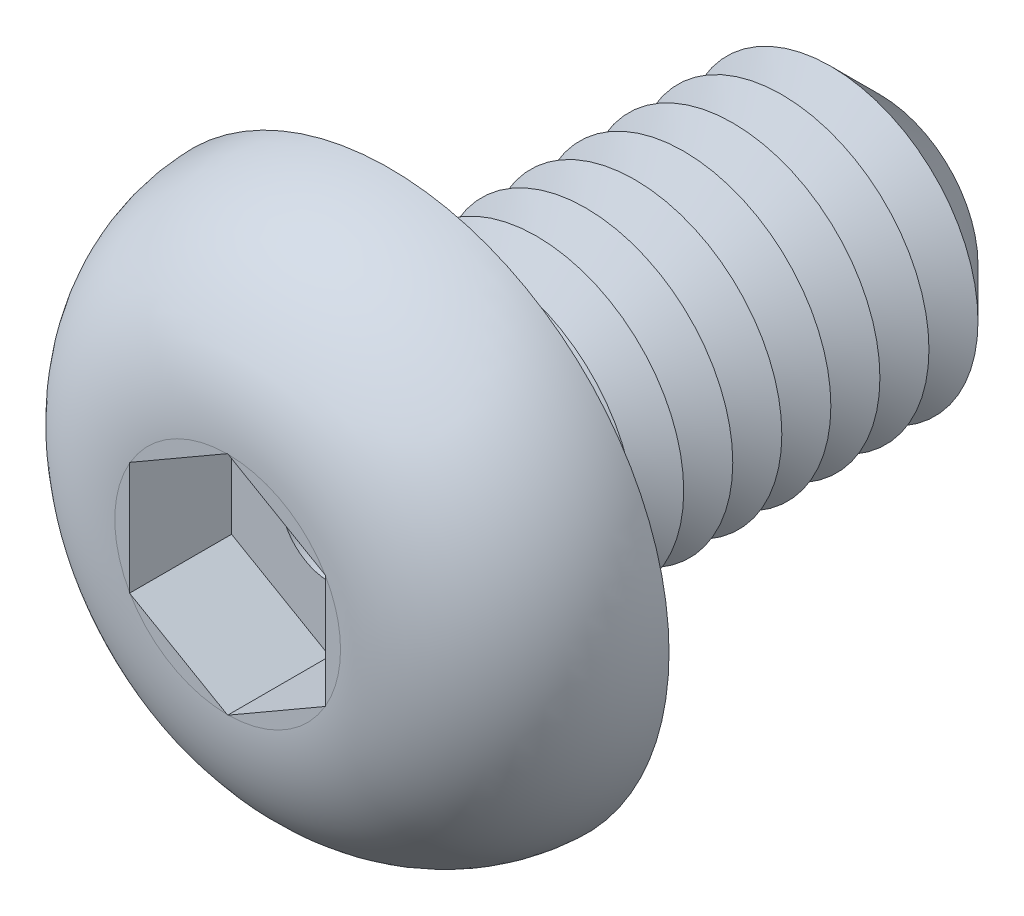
ISO-10303-21;
HEADER;
FILE_DESCRIPTION(('STEP AP214'),'2;1');
FILE_NAME('part.step','',(''),(''),'','','');
FILE_SCHEMA(('AUTOMOTIVE_DESIGN { 1 0 10303 214 1 1 1 1 }'));
ENDSEC;
DATA;
#1=APPLICATION_CONTEXT('core data for automotive mechanical design processes');
#2=APPLICATION_PROTOCOL_DEFINITION('international standard','automotive_design',2000,#1);
#3=PRODUCT_CONTEXT('',#1,'mechanical');
#4=PRODUCT('Part','Part','',(#3));
#5=PRODUCT_RELATED_PRODUCT_CATEGORY('part','',(#4));
#6=PRODUCT_DEFINITION_FORMATION('','',#4);
#7=PRODUCT_DEFINITION_CONTEXT('part definition',#1,'design');
#8=PRODUCT_DEFINITION('design','',#6,#7);
#9=PRODUCT_DEFINITION_SHAPE('','',#8);
#10=(LENGTH_UNIT() NAMED_UNIT(*) SI_UNIT(.MILLI.,.METRE.));
#11=(NAMED_UNIT(*) PLANE_ANGLE_UNIT() SI_UNIT($,.RADIAN.));
#12=(NAMED_UNIT(*) SI_UNIT($,.STERADIAN.) SOLID_ANGLE_UNIT());
#13=UNCERTAINTY_MEASURE_WITH_UNIT(LENGTH_MEASURE(1.E-05),#10,'distance_accuracy_value','');
#14=(GEOMETRIC_REPRESENTATION_CONTEXT(3) GLOBAL_UNCERTAINTY_ASSIGNED_CONTEXT((#13)) GLOBAL_UNIT_ASSIGNED_CONTEXT((#10,
#11,#12)) REPRESENTATION_CONTEXT('',''));
#15=CARTESIAN_POINT('',(0.,0.,0.));
#16=DIRECTION('',(0.,0.,1.));
#17=DIRECTION('',(1.,0.,0.));
#18=AXIS2_PLACEMENT_3D('',#15,#16,#17);
#19=CARTESIAN_POINT('',(0.,0.,-5.));
#20=DIRECTION('',(0.,0.,1.));
#21=DIRECTION('',(1.,0.,0.));
#22=AXIS2_PLACEMENT_3D('',#19,#20,#21);
#23=CYLINDRICAL_SURFACE('',#22,1.5);
#24=CARTESIAN_POINT('',(0.,0.,-0.25));
#25=DIRECTION('',(0.,0.,1.));
#26=DIRECTION('',(1.,0.,0.));
#27=AXIS2_PLACEMENT_3D('',#24,#25,#26);
#28=CIRCLE('',#27,1.5);
#29=CARTESIAN_POINT('',(1.5,0.,-0.25));
#30=VERTEX_POINT('',#29);
#31=EDGE_CURVE('E48',#30,#30,#28,.F.);
#32=ORIENTED_EDGE('',*,*,#31,.T.);
#33=EDGE_LOOP('',(#32));
#34=FACE_BOUND('',#33,.T.);
#35=CARTESIAN_POINT('',(0.,0.,-0.5));
#36=DIRECTION('',(0.,0.,1.));
#37=DIRECTION('',(1.,0.,0.));
#38=AXIS2_PLACEMENT_3D('',#35,#36,#37);
#39=CIRCLE('',#38,1.5);
#40=CARTESIAN_POINT('',(1.5,0.,-0.5));
#41=VERTEX_POINT('',#40);
#42=EDGE_CURVE('E161',#41,#41,#39,.T.);
#43=ORIENTED_EDGE('',*,*,#42,.T.);
#44=EDGE_LOOP('',(#43));
#45=FACE_BOUND('',#44,.T.);
#46=ADVANCED_FACE('F39',(#34,#45),#23,.T.);
#47=CARTESIAN_POINT('',(0.,0.,1.65));
#48=DIRECTION('',(0.,0.,-1.));
#49=DIRECTION('',(-1.,0.,0.));
#50=AXIS2_PLACEMENT_3D('',#47,#48,#49);
#51=PLANE('',#50);
#52=CARTESIAN_POINT('',(0.,0.,1.65));
#53=DIRECTION('',(0.,0.,1.));
#54=DIRECTION('',(1.,0.,0.));
#55=AXIS2_PLACEMENT_3D('',#52,#53,#54);
#56=CIRCLE('',#55,1.15073545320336);
#57=CARTESIAN_POINT('',(0.993096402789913,0.581336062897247,1.65));
#58=VERTEX_POINT('',#57);
#59=CARTESIAN_POINT('',(0.00690359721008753,1.15071474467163,1.65));
#60=VERTEX_POINT('',#59);
#61=EDGE_CURVE('E221',#58,#60,#56,.T.);
#62=ORIENTED_EDGE('',*,*,#61,.T.);
#63=DIRECTION('',(-0.866025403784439,0.5,0.));
#64=VECTOR('',#63,1.);
#65=CARTESIAN_POINT('',(1.,0.577350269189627,1.65));
#66=LINE('',#65,#64);
#67=EDGE_CURVE('E179',#58,#60,#66,.T.);
#68=ORIENTED_EDGE('',*,*,#67,.F.);
#69=EDGE_LOOP('',(#62,#68));
#70=FACE_BOUND('',#69,.T.);
#71=ADVANCED_FACE('F258',(#70),#51,.F.);
#72=CARTESIAN_POINT('',(1.,-0.569378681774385,1.65));
#73=VERTEX_POINT('',#72);
#74=CARTESIAN_POINT('',(1.,0.569378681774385,1.65));
#75=VERTEX_POINT('',#74);
#76=EDGE_CURVE('E216',#73,#75,#56,.T.);
#77=ORIENTED_EDGE('',*,*,#76,.T.);
#78=DIRECTION('',(0.,1.,0.));
#79=VECTOR('',#78,1.);
#80=CARTESIAN_POINT('',(1.,-0.577350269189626,1.65));
#81=LINE('',#80,#79);
#82=EDGE_CURVE('E63',#73,#75,#81,.T.);
#83=ORIENTED_EDGE('',*,*,#82,.F.);
#84=EDGE_LOOP('',(#77,#83));
#85=FACE_BOUND('',#84,.T.);
#86=ADVANCED_FACE('F264',(#85),#51,.F.);
#87=CARTESIAN_POINT('',(0.00690359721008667,-1.15071474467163,1.65));
#88=VERTEX_POINT('',#87);
#89=CARTESIAN_POINT('',(0.993096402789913,-0.581336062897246,1.65));
#90=VERTEX_POINT('',#89);
#91=EDGE_CURVE('E220',#88,#90,#56,.T.);
#92=ORIENTED_EDGE('',*,*,#91,.T.);
#93=DIRECTION('',(0.866025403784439,0.5,0.));
#94=VECTOR('',#93,1.);
#95=CARTESIAN_POINT('',(0.,-1.15470053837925,1.65));
#96=LINE('',#95,#94);
#97=EDGE_CURVE('E191',#88,#90,#96,.T.);
#98=ORIENTED_EDGE('',*,*,#97,.F.);
#99=EDGE_LOOP('',(#92,#98));
#100=FACE_BOUND('',#99,.T.);
#101=ADVANCED_FACE('F326',(#100),#51,.F.);
#102=CARTESIAN_POINT('',(-0.993096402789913,-0.581336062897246,1.65));
#103=VERTEX_POINT('',#102);
#104=CARTESIAN_POINT('',(-0.00690359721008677,-1.15071474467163,1.65));
#105=VERTEX_POINT('',#104);
#106=EDGE_CURVE('E336',#103,#105,#56,.T.);
#107=ORIENTED_EDGE('',*,*,#106,.T.);
#108=DIRECTION('',(0.866025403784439,-0.5,0.));
#109=VECTOR('',#108,1.);
#110=CARTESIAN_POINT('',(-1.,-0.577350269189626,1.65));
#111=LINE('',#110,#109);
#112=EDGE_CURVE('E187',#103,#105,#111,.T.);
#113=ORIENTED_EDGE('',*,*,#112,.F.);
#114=EDGE_LOOP('',(#107,#113));
#115=FACE_BOUND('',#114,.T.);
#116=ADVANCED_FACE('F321',(#115),#51,.F.);
#117=CARTESIAN_POINT('',(-1.,0.569378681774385,1.65));
#118=VERTEX_POINT('',#117);
#119=CARTESIAN_POINT('',(-1.,-0.569378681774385,1.65));
#120=VERTEX_POINT('',#119);
#121=EDGE_CURVE('E331',#118,#120,#56,.T.);
#122=ORIENTED_EDGE('',*,*,#121,.T.);
#123=DIRECTION('',(0.,-1.,0.));
#124=VECTOR('',#123,1.);
#125=CARTESIAN_POINT('',(-1.,0.577350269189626,1.65));
#126=LINE('',#125,#124);
#127=EDGE_CURVE('E183',#118,#120,#126,.T.);
#128=ORIENTED_EDGE('',*,*,#127,.F.);
#129=EDGE_LOOP('',(#122,#128));
#130=FACE_BOUND('',#129,.T.);
#131=ADVANCED_FACE('F312',(#130),#51,.F.);
#132=CARTESIAN_POINT('',(0.,2.85,0.));
#133=DIRECTION('',(0.,0.,1.));
#134=DIRECTION('',(1.,0.,0.));
#135=AXIS2_PLACEMENT_3D('',#132,#133,#134);
#136=PLANE('',#135);
#137=CARTESIAN_POINT('',(0.,0.,0.));
#138=DIRECTION('',(0.,0.,1.));
#139=DIRECTION('',(1.,0.,0.));
#140=AXIS2_PLACEMENT_3D('',#137,#138,#139);
#141=CIRCLE('',#140,1.75);
#142=CARTESIAN_POINT('',(1.75,0.,0.));
#143=VERTEX_POINT('',#142);
#144=EDGE_CURVE('E11',#143,#143,#141,.T.);
#145=ORIENTED_EDGE('',*,*,#144,.T.);
#146=EDGE_LOOP('',(#145));
#147=FACE_BOUND('',#146,.T.);
#148=CARTESIAN_POINT('',(0.,0.,0.));
#149=DIRECTION('',(0.,0.,1.));
#150=DIRECTION('',(1.,0.,0.));
#151=AXIS2_PLACEMENT_3D('',#148,#149,#150);
#152=CIRCLE('',#151,2.85);
#153=CARTESIAN_POINT('',(2.85,0.,0.));
#154=VERTEX_POINT('',#153);
#155=EDGE_CURVE('E198',#154,#154,#152,.T.);
#156=ORIENTED_EDGE('',*,*,#155,.F.);
#157=EDGE_LOOP('',(#156));
#158=FACE_BOUND('',#157,.T.);
#159=ADVANCED_FACE('F309',(#147,#158),#136,.F.);
#160=CARTESIAN_POINT('',(-0.00690359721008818,1.15071474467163,1.65));
#161=VERTEX_POINT('',#160);
#162=CARTESIAN_POINT('',(-0.993096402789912,0.581336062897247,1.65));
#163=VERTEX_POINT('',#162);
#164=EDGE_CURVE('E335',#161,#163,#56,.T.);
#165=ORIENTED_EDGE('',*,*,#164,.T.);
#166=DIRECTION('',(-0.866025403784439,-0.5,0.));
#167=VECTOR('',#166,1.);
#168=CARTESIAN_POINT('',(0.,1.15470053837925,1.65));
#169=LINE('',#168,#167);
#170=EDGE_CURVE('E178',#161,#163,#169,.T.);
#171=ORIENTED_EDGE('',*,*,#170,.F.);
#172=EDGE_LOOP('',(#165,#171));
#173=FACE_BOUND('',#172,.T.);
#174=ADVANCED_FACE('F255',(#173),#51,.F.);
#175=CARTESIAN_POINT('',(0.,0.,-0.0499999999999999));
#176=DIRECTION('',(0.,0.,1.));
#177=DIRECTION('',(1.,0.,0.));
#178=AXIS2_PLACEMENT_3D('',#175,#176,#177);
#179=DEGENERATE_TOROIDAL_SURFACE('',#178,1.15073545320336,1.7,.T.);
#180=ORIENTED_EDGE('',*,*,#61,.F.);
#181=CARTESIAN_POINT('',(1.,0.577350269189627,1.65));
#182=VERTEX_POINT('',#181);
#183=EDGE_CURVE('E175',#182,#58,#66,.T.);
#184=ORIENTED_EDGE('',*,*,#183,.F.);
#185=CARTESIAN_POINT('',(1.,0.,1.64330411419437));
#186=CARTESIAN_POINT('',(1.,-0.041849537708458,1.64330316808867));
#187=CARTESIAN_POINT('',(1.,-0.083698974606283,1.64354559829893));
#188=CARTESIAN_POINT('',(1.,-0.167393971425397,1.64442358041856));
#189=CARTESIAN_POINT('',(1.,-0.209239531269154,1.64505913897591));
#190=CARTESIAN_POINT('',(1.,-0.334845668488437,1.64722576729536));
#191=CARTESIAN_POINT('',(1.,-0.418601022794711,1.64901611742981));
#192=CARTESIAN_POINT('',(1.,-0.585792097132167,1.65039211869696));
#193=CARTESIAN_POINT('',(1.,-0.669227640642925,1.64998722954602));
#194=CARTESIAN_POINT('',(1.,-0.83590094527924,1.6440300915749));
#195=CARTESIAN_POINT('',(1.,-0.919138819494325,1.63848280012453));
#196=CARTESIAN_POINT('',(1.,-1.0594136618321,1.62282805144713));
#197=CARTESIAN_POINT('',(1.,-1.11666006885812,1.61463991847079));
#198=CARTESIAN_POINT('',(1.,-1.23041128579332,1.59417176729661));
#199=CARTESIAN_POINT('',(1.,-1.2869163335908,1.58189309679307));
#200=CARTESIAN_POINT('',(1.,-1.39883762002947,1.55283610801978));
#201=CARTESIAN_POINT('',(1.,-1.45425254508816,1.53605268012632));
#202=CARTESIAN_POINT('',(1.,-1.56342884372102,1.49775525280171));
#203=CARTESIAN_POINT('',(1.,-1.61719032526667,1.47624156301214));
#204=CARTESIAN_POINT('',(1.,-1.72305248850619,1.42814032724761));
#205=CARTESIAN_POINT('',(1.,-1.77513121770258,1.40150424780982));
#206=CARTESIAN_POINT('',(1.,-1.87650034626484,1.34331391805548));
#207=CARTESIAN_POINT('',(1.,-1.92578956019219,1.31175759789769));
#208=CARTESIAN_POINT('',(1.,-2.02094663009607,1.24389579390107));
#209=CARTESIAN_POINT('',(1.,-2.06681670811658,1.20759343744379));
#210=CARTESIAN_POINT('',(1.,-2.15460705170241,1.13048515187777));
#211=CARTESIAN_POINT('',(1.,-2.19652613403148,1.08967788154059));
#212=CARTESIAN_POINT('',(1.,-2.30373588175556,0.973753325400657));
#213=CARTESIAN_POINT('',(1.,-2.36480639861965,0.894640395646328));
#214=CARTESIAN_POINT('',(1.,-2.47150299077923,0.726696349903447));
#215=CARTESIAN_POINT('',(1.,-2.51713890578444,0.637871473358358));
#216=CARTESIAN_POINT('',(1.,-2.58857066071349,0.46005750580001));
#217=CARTESIAN_POINT('',(1.,-2.61556805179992,0.371550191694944));
#218=CARTESIAN_POINT('',(1.,-2.65390085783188,0.191213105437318));
#219=CARTESIAN_POINT('',(1.,-2.66523955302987,0.0993840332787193));
#220=CARTESIAN_POINT('',(1.,-2.67179092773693,-0.0825708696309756));
#221=CARTESIAN_POINT('',(1.,-2.66739421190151,-0.172682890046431));
#222=CARTESIAN_POINT('',(1.,-2.64348567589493,-0.350883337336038));
#223=CARTESIAN_POINT('',(1.,-2.62397312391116,-0.438971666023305));
#224=CARTESIAN_POINT('',(1.,-2.57054048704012,-0.610404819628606));
#225=CARTESIAN_POINT('',(1.,-2.53665793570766,-0.693761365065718));
#226=CARTESIAN_POINT('',(1.,-2.45559893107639,-0.85368978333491));
#227=CARTESIAN_POINT('',(1.,-2.40842683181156,-0.930263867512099));
#228=CARTESIAN_POINT('',(1.,-2.30144802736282,-1.07583692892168));
#229=CARTESIAN_POINT('',(1.,-2.24145688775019,-1.14470015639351));
#230=CARTESIAN_POINT('',(1.,-2.11112251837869,-1.27193159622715));
#231=CARTESIAN_POINT('',(1.,-2.04076746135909,-1.33028764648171));
#232=CARTESIAN_POINT('',(1.,-1.88862864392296,-1.43765509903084));
#233=CARTESIAN_POINT('',(1.,-1.80648025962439,-1.48614793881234));
#234=CARTESIAN_POINT('',(1.,-1.63600727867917,-1.56989445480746));
#235=CARTESIAN_POINT('',(1.,-1.54769931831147,-1.60518226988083));
#236=CARTESIAN_POINT('',(1.,-1.39091080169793,-1.65552596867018));
#237=CARTESIAN_POINT('',(1.,-1.32332513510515,-1.67346211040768));
#238=CARTESIAN_POINT('',(1.,-1.18678249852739,-1.70305339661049));
#239=CARTESIAN_POINT('',(1.,-1.11782507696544,-1.71470643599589));
#240=CARTESIAN_POINT('',(1.,-0.978842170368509,-1.73262758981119));
#241=CARTESIAN_POINT('',(1.,-0.908812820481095,-1.73886428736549));
#242=CARTESIAN_POINT('',(1.,-0.768519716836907,-1.74708473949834));
#243=CARTESIAN_POINT('',(1.,-0.698255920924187,-1.74906768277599));
#244=CARTESIAN_POINT('',(1.,-0.527772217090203,-1.75068316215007));
#245=CARTESIAN_POINT('',(1.,-0.427552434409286,-1.74895318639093));
#246=CARTESIAN_POINT('',(1.,-0.277255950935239,-1.74623781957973));
#247=CARTESIAN_POINT('',(1.,-0.227169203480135,-1.74531275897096));
#248=CARTESIAN_POINT('',(1.,-0.126990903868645,-1.74392135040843));
#249=CARTESIAN_POINT('',(1.,-0.0768993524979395,-1.74345496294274));
#250=CARTESIAN_POINT('',(1.,0.0232954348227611,-1.7432171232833));
#251=CARTESIAN_POINT('',(1.,0.0733986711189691,-1.74344580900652));
#252=CARTESIAN_POINT('',(1.,0.173601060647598,-1.74448066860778));
#253=CARTESIAN_POINT('',(1.,0.223700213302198,-1.74528688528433));
#254=CARTESIAN_POINT('',(1.,0.374032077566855,-1.74796102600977));
#255=CARTESIAN_POINT('',(1.,0.474263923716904,-1.7500840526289));
#256=CARTESIAN_POINT('',(1.,0.646038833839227,-1.74993675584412));
#257=CARTESIAN_POINT('',(1.,0.717572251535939,-1.74875105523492));
#258=CARTESIAN_POINT('',(1.,0.860467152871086,-1.74232930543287));
#259=CARTESIAN_POINT('',(1.,0.931828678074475,-1.73709436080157));
#260=CARTESIAN_POINT('',(1.,1.07356885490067,-1.72122033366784));
#261=CARTESIAN_POINT('',(1.,1.14395079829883,-1.71061248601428));
#262=CARTESIAN_POINT('',(1.,1.28345101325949,-1.6830362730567));
#263=CARTESIAN_POINT('',(1.,1.35256960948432,-1.66606956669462));
#264=CARTESIAN_POINT('',(1.,1.51915230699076,-1.61597650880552));
#265=CARTESIAN_POINT('',(1.,1.61551282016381,-1.5790180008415));
#266=CARTESIAN_POINT('',(1.,1.80117858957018,-1.48957694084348));
#267=CARTESIAN_POINT('',(1.,1.89046083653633,-1.43704619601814));
#268=CARTESIAN_POINT('',(1.,2.05877104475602,-1.31682583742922));
#269=CARTESIAN_POINT('',(1.,2.13775712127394,-1.24907718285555));
#270=CARTESIAN_POINT('',(1.,2.28184060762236,-1.10027015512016));
#271=CARTESIAN_POINT('',(0.999999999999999,2.34695771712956,-1.01923095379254));
#272=CARTESIAN_POINT('',(0.999999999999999,2.45608578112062,-0.853423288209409));
#273=CARTESIAN_POINT('',(0.999999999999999,2.50138780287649,-0.769502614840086));
#274=CARTESIAN_POINT('',(0.999999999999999,2.5765359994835,-0.594973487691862));
#275=CARTESIAN_POINT('',(0.999999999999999,2.60638146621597,-0.504364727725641));
#276=CARTESIAN_POINT('',(0.999999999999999,2.64857466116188,-0.32334889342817));
#277=CARTESIAN_POINT('',(0.999999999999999,2.66163020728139,-0.233106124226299));
#278=CARTESIAN_POINT('',(0.999999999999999,2.67217366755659,-0.0517287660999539));
#279=CARTESIAN_POINT('',(0.999999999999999,2.66966509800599,0.0394056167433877));
#280=CARTESIAN_POINT('',(0.999999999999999,2.64931179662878,0.218675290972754));
#281=CARTESIAN_POINT('',(0.999999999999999,2.63167707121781,0.306834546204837));
#282=CARTESIAN_POINT('',(0.999999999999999,2.58192713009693,0.478965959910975));
#283=CARTESIAN_POINT('',(0.999999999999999,2.54981137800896,0.56293796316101));
#284=CARTESIAN_POINT('',(0.999999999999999,2.47193161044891,0.724823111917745));
#285=CARTESIAN_POINT('',(0.999999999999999,2.42609746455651,0.802702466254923));
#286=CARTESIAN_POINT('',(0.999999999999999,2.32231485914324,0.949889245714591));
#287=CARTESIAN_POINT('',(1.,2.26436747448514,1.01919743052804));
#288=CARTESIAN_POINT('',(1.,2.13654618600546,1.14929270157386));
#289=CARTESIAN_POINT('',(1.,2.06640512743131,1.20981647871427));
#290=CARTESIAN_POINT('',(1.,1.9173872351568,1.31904487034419));
#291=CARTESIAN_POINT('',(1.,1.83850453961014,1.36774148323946));
#292=CARTESIAN_POINT('',(1.,1.71289874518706,1.4328215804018));
#293=CARTESIAN_POINT('',(1.,1.66841297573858,1.45365843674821));
#294=CARTESIAN_POINT('',(1.,1.57796501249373,1.49187589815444));
#295=CARTESIAN_POINT('',(1.,1.53200259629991,1.50925597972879));
#296=CARTESIAN_POINT('',(1.,1.43903939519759,1.54059227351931));
#297=CARTESIAN_POINT('',(1.,1.39204097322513,1.55455554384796));
#298=CARTESIAN_POINT('',(1.,1.29722920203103,1.57925913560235));
#299=CARTESIAN_POINT('',(1.,1.24941611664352,1.59000048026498));
#300=CARTESIAN_POINT('',(1.,1.10320842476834,1.61808076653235));
#301=CARTESIAN_POINT('',(1.,1.00389041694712,1.63067408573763));
#302=CARTESIAN_POINT('',(1.,0.804462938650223,1.6463207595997));
#303=CARTESIAN_POINT('',(1.,0.704352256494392,1.64935433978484));
#304=CARTESIAN_POINT('',(1.,0.503474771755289,1.65046619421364));
#305=CARTESIAN_POINT('',(1.,0.402708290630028,1.64850957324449));
#306=CARTESIAN_POINT('',(1.,0.25162232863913,1.64577086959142));
#307=CARTESIAN_POINT('',(1.,0.201301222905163,1.64489114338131));
#308=CARTESIAN_POINT('',(1.,0.100653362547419,1.64365834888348));
#309=CARTESIAN_POINT('',(1.,0.0503266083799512,1.64330525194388));
#310=CARTESIAN_POINT('',(1.,0.,1.64330411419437));
#311=B_SPLINE_CURVE_WITH_KNOTS('',3,(#185,#186,#187,#188,#189,#190,#191,#192,#193,#194,#195,
#196,#197,#198,#199,#200,#201,#202,#203,#204,#205,#206,#207,#208,#209,#210,#211,#212,#213,#214,
#215,#216,#217,#218,#219,#220,#221,#222,#223,#224,#225,#226,#227,#228,#229,#230,#231,#232,#233,
#234,#235,#236,#237,#238,#239,#240,#241,#242,#243,#244,#245,#246,#247,#248,#249,#250,#251,#252,
#253,#254,#255,#256,#257,#258,#259,#260,#261,#262,#263,#264,#265,#266,#267,#268,#269,#270,#271,
#272,#273,#274,#275,#276,#277,#278,#279,#280,#281,#282,#283,#284,#285,#286,#287,#288,#289,#290,
#291,#292,#293,#294,#295,#296,#297,#298,#299,#300,#301,#302,#303,#304,#305,#306,#307,#308,#309,
#310),.UNSPECIFIED.,.T.,.F.,(4,2,2,2,2,2,2,2,2,2,2,2,2,2,2,2,2,2,2,2,2,2,2,2,2,2,2,2,2,2,2,2,2,
2,2,2,2,2,2,2,2,2,2,2,2,2,2,2,2,2,2,2,2,2,2,2,2,2,2,2,2,2,4),(0.,0.125547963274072,
0.251098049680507,0.502422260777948,0.752664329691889,1.00266541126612,1.17602519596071,
1.34932792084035,1.52282805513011,1.69631683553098,1.87153849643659,2.04683406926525,
2.22201470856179,2.39724764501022,2.69534138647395,2.99324473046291,3.26948200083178,
3.54566139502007,3.81503317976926,4.08441800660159,4.35310350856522,4.62170108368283,
4.89446026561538,5.16753316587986,5.45251589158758,5.73675667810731,5.94622800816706,
6.15576947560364,6.3665183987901,6.57730751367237,6.87796487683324,7.02825425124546,
7.17853067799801,7.32883692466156,7.47915431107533,7.77989491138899,7.99445526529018,
8.20895711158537,8.42222604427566,8.63543937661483,8.94372593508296,9.25297671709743,
9.56344868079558,9.87347666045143,10.1581355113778,10.4428074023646,10.715036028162,
10.9872031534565,11.2556516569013,11.5241101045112,11.7939650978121,12.0637961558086,
12.3405292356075,12.6174490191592,12.7646985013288,12.9119702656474,13.0589351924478,
13.2058533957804,13.5054664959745,13.8056989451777,14.1080365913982,14.2590238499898,
14.410002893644),.UNSPECIFIED.);
#312=EDGE_CURVE('E279',#182,#75,#311,.T.);
#313=ORIENTED_EDGE('',*,*,#312,.T.);
#314=ORIENTED_EDGE('',*,*,#76,.F.);
#315=CARTESIAN_POINT('',(1.,-0.577350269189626,1.65));
#316=VERTEX_POINT('',#315);
#317=EDGE_CURVE('E154',#316,#73,#81,.T.);
#318=ORIENTED_EDGE('',*,*,#317,.F.);
#319=CARTESIAN_POINT('',(1.0002,-0.577234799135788,1.64999510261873));
#320=CARTESIAN_POINT('',(0.958507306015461,-0.601306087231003,1.65004608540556));
#321=CARTESIAN_POINT('',(0.916820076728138,-0.625374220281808,1.64959104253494));
#322=CARTESIAN_POINT('',(0.833446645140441,-0.673509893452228,1.64822305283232));
#323=CARTESIAN_POINT('',(0.791760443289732,-0.697577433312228,1.6473100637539));
#324=CARTESIAN_POINT('',(0.708395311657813,-0.745708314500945,1.64558069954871));
#325=CARTESIAN_POINT('',(0.666716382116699,-0.769771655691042,1.64476430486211));
#326=CARTESIAN_POINT('',(0.58335598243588,-0.817899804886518,1.64362601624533));
#327=CARTESIAN_POINT('',(0.541674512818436,-0.841964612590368,1.64330408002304));
#328=CARTESIAN_POINT('',(0.45831273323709,-0.890093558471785,1.64330414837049));
#329=CARTESIAN_POINT('',(0.416632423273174,-0.914157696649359,1.64362613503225));
#330=CARTESIAN_POINT('',(0.333274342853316,-0.962284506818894,1.64476447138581));
#331=CARTESIAN_POINT('',(0.291596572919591,-0.986347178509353,1.64558086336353));
#332=CARTESIAN_POINT('',(0.208233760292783,-1.03447672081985,1.64731018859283));
#333=CARTESIAN_POINT('',(0.166548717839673,-1.05854359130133,1.64822314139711));
#334=CARTESIAN_POINT('',(0.083177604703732,-1.106677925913,1.64959106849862));
#335=CARTESIAN_POINT('',(0.0414915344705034,-1.13074538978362,1.65004608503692));
#336=CARTESIAN_POINT('',(-0.00019999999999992,-1.15481600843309,1.64999510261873));
#337=B_SPLINE_CURVE_WITH_KNOTS('',3,(#319,#320,#321,#322,#323,#324,#325,#326,#327,#328,#329,
#330,#331,#332,#333,#334,#335,#336),.UNSPECIFIED.,.F.,.F.,(4,2,2,2,2,2,2,2,4),(0.,
0.144416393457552,0.288846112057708,0.433246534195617,0.577634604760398,0.722018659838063,
0.866415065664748,1.01084076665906,1.15525314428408),.UNSPECIFIED.);
#338=EDGE_CURVE('E286',#316,#90,#337,.T.);
#339=ORIENTED_EDGE('',*,*,#338,.T.);
#340=ORIENTED_EDGE('',*,*,#91,.F.);
#341=CARTESIAN_POINT('',(0.,-1.15470053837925,1.65));
#342=VERTEX_POINT('',#341);
#343=EDGE_CURVE('E192',#342,#88,#96,.T.);
#344=ORIENTED_EDGE('',*,*,#343,.F.);
#345=CARTESIAN_POINT('',(0.000200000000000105,-1.15481600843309,1.64999510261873));
#346=CARTESIAN_POINT('',(-0.0414926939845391,-1.13074472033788,1.65004608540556));
#347=CARTESIAN_POINT('',(-0.083179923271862,-1.10667658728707,1.64959104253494));
#348=CARTESIAN_POINT('',(-0.166553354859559,-1.05854091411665,1.64822305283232));
#349=CARTESIAN_POINT('',(-0.208239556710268,-1.03447337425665,1.6473100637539));
#350=CARTESIAN_POINT('',(-0.291604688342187,-0.986342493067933,1.64558069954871));
#351=CARTESIAN_POINT('',(-0.3332836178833,-0.962279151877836,1.64476430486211));
#352=CARTESIAN_POINT('',(-0.41664401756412,-0.91415100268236,1.64362601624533));
#353=CARTESIAN_POINT('',(-0.458325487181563,-0.89008619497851,1.64330408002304));
#354=CARTESIAN_POINT('',(-0.54168726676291,-0.841957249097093,1.64330414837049));
#355=CARTESIAN_POINT('',(-0.583367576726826,-0.817893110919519,1.64362613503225));
#356=CARTESIAN_POINT('',(-0.666725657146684,-0.769766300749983,1.64476447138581));
#357=CARTESIAN_POINT('',(-0.708403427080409,-0.745703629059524,1.64558086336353));
#358=CARTESIAN_POINT('',(-0.791766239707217,-0.697574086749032,1.64731018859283));
#359=CARTESIAN_POINT('',(-0.833451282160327,-0.673507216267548,1.64822314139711));
#360=CARTESIAN_POINT('',(-0.916822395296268,-0.625372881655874,1.64959106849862));
#361=CARTESIAN_POINT('',(-0.958508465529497,-0.601305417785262,1.65004608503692));
#362=CARTESIAN_POINT('',(-1.0002,-0.577234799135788,1.64999510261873));
#363=B_SPLINE_CURVE_WITH_KNOTS('',3,(#345,#346,#347,#348,#349,#350,#351,#352,#353,#354,#355,
#356,#357,#358,#359,#360,#361,#362),.UNSPECIFIED.,.F.,.F.,(4,2,2,2,2,2,2,2,4),(0.,
0.144416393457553,0.288846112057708,0.433246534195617,0.577634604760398,0.722018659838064,
0.866415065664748,1.01084076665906,1.15525314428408),.UNSPECIFIED.);
#364=EDGE_CURVE('E360',#342,#105,#363,.T.);
#365=ORIENTED_EDGE('',*,*,#364,.T.);
#366=ORIENTED_EDGE('',*,*,#106,.F.);
#367=CARTESIAN_POINT('',(-1.,-0.577350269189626,1.65));
#368=VERTEX_POINT('',#367);
#369=EDGE_CURVE('E188',#368,#103,#111,.T.);
#370=ORIENTED_EDGE('',*,*,#369,.F.);
#371=CARTESIAN_POINT('',(-1.,0.,1.64330411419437));
#372=CARTESIAN_POINT('',(-1.,0.0418495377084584,1.64330316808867));
#373=CARTESIAN_POINT('',(-1.,0.0836989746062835,1.64354559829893));
#374=CARTESIAN_POINT('',(-1.,0.167393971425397,1.64442358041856));
#375=CARTESIAN_POINT('',(-1.,0.209239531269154,1.64505913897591));
#376=CARTESIAN_POINT('',(-1.,0.334845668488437,1.64722576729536));
#377=CARTESIAN_POINT('',(-1.,0.418601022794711,1.64901611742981));
#378=CARTESIAN_POINT('',(-1.,0.585792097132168,1.65039211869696));
#379=CARTESIAN_POINT('',(-1.,0.669227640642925,1.64998722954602));
#380=CARTESIAN_POINT('',(-1.,0.83590094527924,1.6440300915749));
#381=CARTESIAN_POINT('',(-1.,0.919138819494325,1.63848280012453));
#382=CARTESIAN_POINT('',(-1.,1.0594136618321,1.62282805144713));
#383=CARTESIAN_POINT('',(-1.,1.11666006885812,1.61463991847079));
#384=CARTESIAN_POINT('',(-1.,1.23041128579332,1.59417176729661));
#385=CARTESIAN_POINT('',(-1.,1.2869163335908,1.58189309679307));
#386=CARTESIAN_POINT('',(-1.,1.39883762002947,1.55283610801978));
#387=CARTESIAN_POINT('',(-1.,1.45425254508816,1.53605268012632));
#388=CARTESIAN_POINT('',(-1.,1.56342884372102,1.49775525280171));
#389=CARTESIAN_POINT('',(-1.,1.61719032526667,1.47624156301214));
#390=CARTESIAN_POINT('',(-1.,1.72305248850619,1.42814032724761));
#391=CARTESIAN_POINT('',(-1.,1.77513121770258,1.40150424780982));
#392=CARTESIAN_POINT('',(-1.,1.87650034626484,1.34331391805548));
#393=CARTESIAN_POINT('',(-1.,1.92578956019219,1.31175759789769));
#394=CARTESIAN_POINT('',(-1.,2.02094663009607,1.24389579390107));
#395=CARTESIAN_POINT('',(-1.,2.06681670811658,1.20759343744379));
#396=CARTESIAN_POINT('',(-1.,2.15460705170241,1.13048515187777));
#397=CARTESIAN_POINT('',(-1.,2.19652613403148,1.08967788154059));
#398=CARTESIAN_POINT('',(-1.,2.30373588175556,0.973753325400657));
#399=CARTESIAN_POINT('',(-1.,2.36480639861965,0.894640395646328));
#400=CARTESIAN_POINT('',(-1.,2.47150299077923,0.726696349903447));
#401=CARTESIAN_POINT('',(-1.,2.51713890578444,0.637871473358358));
#402=CARTESIAN_POINT('',(-1.,2.58857066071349,0.46005750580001));
#403=CARTESIAN_POINT('',(-1.,2.61556805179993,0.371550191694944));
#404=CARTESIAN_POINT('',(-1.,2.65390085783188,0.191213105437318));
#405=CARTESIAN_POINT('',(-1.,2.66523955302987,0.0993840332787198));
#406=CARTESIAN_POINT('',(-1.,2.67179092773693,-0.0825708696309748));
#407=CARTESIAN_POINT('',(-1.,2.66739421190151,-0.17268289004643));
#408=CARTESIAN_POINT('',(-1.,2.64348567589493,-0.350883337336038));
#409=CARTESIAN_POINT('',(-1.,2.62397312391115,-0.438971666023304));
#410=CARTESIAN_POINT('',(-1.,2.57054048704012,-0.610404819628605));
#411=CARTESIAN_POINT('',(-1.,2.53665793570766,-0.693761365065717));
#412=CARTESIAN_POINT('',(-1.,2.45559893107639,-0.853689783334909));
#413=CARTESIAN_POINT('',(-1.,2.40842683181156,-0.930263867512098));
#414=CARTESIAN_POINT('',(-1.,2.30144802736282,-1.07583692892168));
#415=CARTESIAN_POINT('',(-1.,2.24145688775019,-1.14470015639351));
#416=CARTESIAN_POINT('',(-1.,2.11112251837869,-1.27193159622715));
#417=CARTESIAN_POINT('',(-1.,2.04076746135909,-1.33028764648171));
#418=CARTESIAN_POINT('',(-1.,1.88862864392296,-1.43765509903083));
#419=CARTESIAN_POINT('',(-1.,1.80648025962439,-1.48614793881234));
#420=CARTESIAN_POINT('',(-1.,1.63600727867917,-1.56989445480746));
#421=CARTESIAN_POINT('',(-1.,1.54769931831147,-1.60518226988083));
#422=CARTESIAN_POINT('',(-1.,1.39091080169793,-1.65552596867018));
#423=CARTESIAN_POINT('',(-1.,1.32332513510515,-1.67346211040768));
#424=CARTESIAN_POINT('',(-1.,1.18678249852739,-1.70305339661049));
#425=CARTESIAN_POINT('',(-1.,1.11782507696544,-1.71470643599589));
#426=CARTESIAN_POINT('',(-1.,0.97884217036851,-1.73262758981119));
#427=CARTESIAN_POINT('',(-1.,0.908812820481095,-1.73886428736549));
#428=CARTESIAN_POINT('',(-1.,0.768519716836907,-1.74708473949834));
#429=CARTESIAN_POINT('',(-1.,0.698255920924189,-1.74906768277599));
#430=CARTESIAN_POINT('',(-1.,0.527772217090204,-1.75068316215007));
#431=CARTESIAN_POINT('',(-1.,0.427552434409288,-1.74895318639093));
#432=CARTESIAN_POINT('',(-1.,0.277255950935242,-1.74623781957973));
#433=CARTESIAN_POINT('',(-1.,0.227169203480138,-1.74531275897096));
#434=CARTESIAN_POINT('',(-1.,0.126990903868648,-1.74392135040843));
#435=CARTESIAN_POINT('',(-1.,0.0768993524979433,-1.74345496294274));
#436=CARTESIAN_POINT('',(-1.,-0.0232954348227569,-1.7432171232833));
#437=CARTESIAN_POINT('',(-1.,-0.0733986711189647,-1.74344580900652));
#438=CARTESIAN_POINT('',(-1.,-0.173601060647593,-1.74448066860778));
#439=CARTESIAN_POINT('',(-1.,-0.223700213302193,-1.74528688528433));
#440=CARTESIAN_POINT('',(-1.,-0.374032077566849,-1.74796102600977));
#441=CARTESIAN_POINT('',(-1.,-0.474263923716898,-1.7500840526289));
#442=CARTESIAN_POINT('',(-1.,-0.646038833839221,-1.74993675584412));
#443=CARTESIAN_POINT('',(-1.,-0.717572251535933,-1.74875105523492));
#444=CARTESIAN_POINT('',(-1.,-0.86046715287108,-1.74232930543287));
#445=CARTESIAN_POINT('',(-1.,-0.931828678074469,-1.73709436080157));
#446=CARTESIAN_POINT('',(-1.,-1.07356885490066,-1.72122033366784));
#447=CARTESIAN_POINT('',(-1.,-1.14395079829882,-1.71061248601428));
#448=CARTESIAN_POINT('',(-1.,-1.28345101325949,-1.6830362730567));
#449=CARTESIAN_POINT('',(-1.,-1.35256960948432,-1.66606956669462));
#450=CARTESIAN_POINT('',(-1.,-1.51915230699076,-1.61597650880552));
#451=CARTESIAN_POINT('',(-1.,-1.61551282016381,-1.5790180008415));
#452=CARTESIAN_POINT('',(-1.,-1.80117858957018,-1.48957694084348));
#453=CARTESIAN_POINT('',(-1.,-1.89046083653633,-1.43704619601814));
#454=CARTESIAN_POINT('',(-1.,-2.05877104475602,-1.31682583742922));
#455=CARTESIAN_POINT('',(-1.,-2.13775712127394,-1.24907718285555));
#456=CARTESIAN_POINT('',(-1.,-2.28184060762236,-1.10027015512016));
#457=CARTESIAN_POINT('',(-1.,-2.34695771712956,-1.01923095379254));
#458=CARTESIAN_POINT('',(-1.,-2.45608578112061,-0.853423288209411));
#459=CARTESIAN_POINT('',(-1.,-2.50138780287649,-0.769502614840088));
#460=CARTESIAN_POINT('',(-1.,-2.5765359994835,-0.594973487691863));
#461=CARTESIAN_POINT('',(-1.,-2.60638146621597,-0.504364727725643));
#462=CARTESIAN_POINT('',(-1.,-2.64857466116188,-0.323348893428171));
#463=CARTESIAN_POINT('',(-1.,-2.66163020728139,-0.2331061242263));
#464=CARTESIAN_POINT('',(-1.,-2.67217366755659,-0.0517287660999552));
#465=CARTESIAN_POINT('',(-1.,-2.66966509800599,0.0394056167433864));
#466=CARTESIAN_POINT('',(-1.,-2.64931179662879,0.218675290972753));
#467=CARTESIAN_POINT('',(-1.,-2.63167707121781,0.306834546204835));
#468=CARTESIAN_POINT('',(-1.,-2.58192713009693,0.478965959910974));
#469=CARTESIAN_POINT('',(-1.,-2.54981137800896,0.562937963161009));
#470=CARTESIAN_POINT('',(-1.,-2.47193161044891,0.724823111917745));
#471=CARTESIAN_POINT('',(-1.,-2.42609746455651,0.802702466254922));
#472=CARTESIAN_POINT('',(-1.,-2.32231485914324,0.94988924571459));
#473=CARTESIAN_POINT('',(-1.,-2.26436747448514,1.01919743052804));
#474=CARTESIAN_POINT('',(-1.,-2.13654618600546,1.14929270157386));
#475=CARTESIAN_POINT('',(-1.,-2.06640512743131,1.20981647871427));
#476=CARTESIAN_POINT('',(-1.,-1.9173872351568,1.31904487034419));
#477=CARTESIAN_POINT('',(-1.,-1.83850453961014,1.36774148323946));
#478=CARTESIAN_POINT('',(-1.,-1.71289874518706,1.4328215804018));
#479=CARTESIAN_POINT('',(-1.,-1.66841297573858,1.45365843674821));
#480=CARTESIAN_POINT('',(-1.,-1.57796501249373,1.49187589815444));
#481=CARTESIAN_POINT('',(-1.,-1.53200259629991,1.50925597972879));
#482=CARTESIAN_POINT('',(-1.,-1.43903939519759,1.54059227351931));
#483=CARTESIAN_POINT('',(-1.,-1.39204097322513,1.55455554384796));
#484=CARTESIAN_POINT('',(-1.,-1.29722920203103,1.57925913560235));
#485=CARTESIAN_POINT('',(-1.,-1.24941611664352,1.59000048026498));
#486=CARTESIAN_POINT('',(-1.,-1.10320842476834,1.61808076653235));
#487=CARTESIAN_POINT('',(-1.,-1.00389041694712,1.63067408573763));
#488=CARTESIAN_POINT('',(-1.,-0.804462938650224,1.6463207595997));
#489=CARTESIAN_POINT('',(-1.,-0.704352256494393,1.64935433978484));
#490=CARTESIAN_POINT('',(-1.,-0.503474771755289,1.65046619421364));
#491=CARTESIAN_POINT('',(-1.,-0.402708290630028,1.64850957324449));
#492=CARTESIAN_POINT('',(-1.,-0.251622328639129,1.64577086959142));
#493=CARTESIAN_POINT('',(-1.,-0.201301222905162,1.64489114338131));
#494=CARTESIAN_POINT('',(-1.,-0.100653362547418,1.64365834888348));
#495=CARTESIAN_POINT('',(-1.,-0.0503266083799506,1.64330525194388));
#496=CARTESIAN_POINT('',(-1.,0.,1.64330411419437));
#497=B_SPLINE_CURVE_WITH_KNOTS('',3,(#371,#372,#373,#374,#375,#376,#377,#378,#379,#380,#381,
#382,#383,#384,#385,#386,#387,#388,#389,#390,#391,#392,#393,#394,#395,#396,#397,#398,#399,#400,
#401,#402,#403,#404,#405,#406,#407,#408,#409,#410,#411,#412,#413,#414,#415,#416,#417,#418,#419,
#420,#421,#422,#423,#424,#425,#426,#427,#428,#429,#430,#431,#432,#433,#434,#435,#436,#437,#438,
#439,#440,#441,#442,#443,#444,#445,#446,#447,#448,#449,#450,#451,#452,#453,#454,#455,#456,#457,
#458,#459,#460,#461,#462,#463,#464,#465,#466,#467,#468,#469,#470,#471,#472,#473,#474,#475,#476,
#477,#478,#479,#480,#481,#482,#483,#484,#485,#486,#487,#488,#489,#490,#491,#492,#493,#494,#495,
#496),.UNSPECIFIED.,.T.,.F.,(4,2,2,2,2,2,2,2,2,2,2,2,2,2,2,2,2,2,2,2,2,2,2,2,2,2,2,2,2,2,2,2,2,
2,2,2,2,2,2,2,2,2,2,2,2,2,2,2,2,2,2,2,2,2,2,2,2,2,2,2,2,2,4),(0.,0.125547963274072,
0.251098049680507,0.502422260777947,0.752664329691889,1.00266541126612,1.17602519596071,
1.34932792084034,1.52282805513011,1.69631683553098,1.87153849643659,2.04683406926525,
2.22201470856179,2.39724764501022,2.69534138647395,2.99324473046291,3.26948200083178,
3.54566139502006,3.81503317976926,4.08441800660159,4.35310350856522,4.62170108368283,
4.89446026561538,5.16753316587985,5.45251589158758,5.73675667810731,5.94622800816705,
6.15576947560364,6.3665183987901,6.57730751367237,6.87796487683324,7.02825425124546,
7.17853067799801,7.32883692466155,7.47915431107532,7.77989491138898,7.99445526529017,
8.20895711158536,8.42222604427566,8.63543937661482,8.94372593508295,9.25297671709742,
9.56344868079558,9.87347666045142,10.1581355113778,10.4428074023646,10.715036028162,
10.9872031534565,11.2556516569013,11.5241101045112,11.7939650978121,12.0637961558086,
12.3405292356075,12.6174490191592,12.7646985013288,12.9119702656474,13.0589351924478,
13.2058533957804,13.5054664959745,13.8056989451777,14.1080365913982,14.2590238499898,
14.410002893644),.UNSPECIFIED.);
#498=EDGE_CURVE('E231',#368,#120,#497,.T.);
#499=ORIENTED_EDGE('',*,*,#498,.T.);
#500=ORIENTED_EDGE('',*,*,#121,.F.);
#501=CARTESIAN_POINT('',(-1.,0.577350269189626,1.65));
#502=VERTEX_POINT('',#501);
#503=EDGE_CURVE('E184',#502,#118,#126,.T.);
#504=ORIENTED_EDGE('',*,*,#503,.F.);
#505=CARTESIAN_POINT('',(-1.0002,0.577234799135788,1.64999510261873));
#506=CARTESIAN_POINT('',(-0.958507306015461,0.601306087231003,1.65004608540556));
#507=CARTESIAN_POINT('',(-0.916820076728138,0.625374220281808,1.64959104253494));
#508=CARTESIAN_POINT('',(-0.833446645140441,0.673509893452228,1.64822305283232));
#509=CARTESIAN_POINT('',(-0.791760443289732,0.697577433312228,1.6473100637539));
#510=CARTESIAN_POINT('',(-0.708395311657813,0.745708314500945,1.64558069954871));
#511=CARTESIAN_POINT('',(-0.666716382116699,0.769771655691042,1.64476430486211));
#512=CARTESIAN_POINT('',(-0.58335598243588,0.817899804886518,1.64362601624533));
#513=CARTESIAN_POINT('',(-0.541674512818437,0.841964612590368,1.64330408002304));
#514=CARTESIAN_POINT('',(-0.45831273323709,0.890093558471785,1.64330414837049));
#515=CARTESIAN_POINT('',(-0.416632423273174,0.914157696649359,1.64362613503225));
#516=CARTESIAN_POINT('',(-0.333274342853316,0.962284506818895,1.64476447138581));
#517=CARTESIAN_POINT('',(-0.291596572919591,0.986347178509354,1.64558086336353));
#518=CARTESIAN_POINT('',(-0.208233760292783,1.03447672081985,1.64731018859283));
#519=CARTESIAN_POINT('',(-0.166548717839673,1.05854359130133,1.64822314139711));
#520=CARTESIAN_POINT('',(-0.0831776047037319,1.106677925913,1.64959106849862));
#521=CARTESIAN_POINT('',(-0.0414915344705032,1.13074538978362,1.65004608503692));
#522=CARTESIAN_POINT('',(0.000200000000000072,1.15481600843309,1.64999510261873));
#523=B_SPLINE_CURVE_WITH_KNOTS('',3,(#505,#506,#507,#508,#509,#510,#511,#512,#513,#514,#515,
#516,#517,#518,#519,#520,#521,#522),.UNSPECIFIED.,.F.,.F.,(4,2,2,2,2,2,2,2,4),(0.,
0.144416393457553,0.288846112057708,0.433246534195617,0.577634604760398,0.722018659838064,
0.866415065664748,1.01084076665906,1.15525314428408),.UNSPECIFIED.);
#524=EDGE_CURVE('E222',#502,#163,#523,.T.);
#525=ORIENTED_EDGE('',*,*,#524,.T.);
#526=ORIENTED_EDGE('',*,*,#164,.F.);
#527=CARTESIAN_POINT('',(-4.67015434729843E-09,1.15470053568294,1.64999537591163));
#528=VERTEX_POINT('',#527);
#529=EDGE_CURVE('E180',#528,#161,#169,.T.);
#530=ORIENTED_EDGE('',*,*,#529,.F.);
#531=CARTESIAN_POINT('',(-0.000199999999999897,1.15481600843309,1.64999510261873));
#532=CARTESIAN_POINT('',(0.0414926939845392,1.13074472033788,1.65004608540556));
#533=CARTESIAN_POINT('',(0.0831799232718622,1.10667658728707,1.64959104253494));
#534=CARTESIAN_POINT('',(0.166553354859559,1.05854091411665,1.64822305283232));
#535=CARTESIAN_POINT('',(0.208239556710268,1.03447337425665,1.6473100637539));
#536=CARTESIAN_POINT('',(0.291604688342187,0.986342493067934,1.64558069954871));
#537=CARTESIAN_POINT('',(0.333283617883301,0.962279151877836,1.64476430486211));
#538=CARTESIAN_POINT('',(0.41664401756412,0.91415100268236,1.64362601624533));
#539=CARTESIAN_POINT('',(0.458325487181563,0.89008619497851,1.64330408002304));
#540=CARTESIAN_POINT('',(0.54168726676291,0.841957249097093,1.64330414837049));
#541=CARTESIAN_POINT('',(0.583367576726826,0.817893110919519,1.64362613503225));
#542=CARTESIAN_POINT('',(0.666725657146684,0.769766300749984,1.64476447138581));
#543=CARTESIAN_POINT('',(0.708403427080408,0.745703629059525,1.64558086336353));
#544=CARTESIAN_POINT('',(0.791766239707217,0.697574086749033,1.64731018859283));
#545=CARTESIAN_POINT('',(0.833451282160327,0.673507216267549,1.64822314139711));
#546=CARTESIAN_POINT('',(0.916822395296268,0.625372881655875,1.64959106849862));
#547=CARTESIAN_POINT('',(0.958508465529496,0.601305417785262,1.65004608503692));
#548=CARTESIAN_POINT('',(1.0002,0.577234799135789,1.64999510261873));
#549=B_SPLINE_CURVE_WITH_KNOTS('',3,(#531,#532,#533,#534,#535,#536,#537,#538,#539,#540,#541,
#542,#543,#544,#545,#546,#547,#548),.UNSPECIFIED.,.F.,.F.,(4,2,2,2,2,2,2,2,4),(0.,
0.144416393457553,0.288846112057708,0.433246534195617,0.577634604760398,0.722018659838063,
0.866415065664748,1.01084076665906,1.15525314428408),.UNSPECIFIED.);
#550=EDGE_CURVE('E134',#528,#60,#549,.T.);
#551=ORIENTED_EDGE('',*,*,#550,.T.);
#552=EDGE_LOOP('',(#180,#184,#313,#314,#318,#339,#340,#344,#365,#366,#370,#499,#500,#504,#525,
#526,#530,#551));
#553=FACE_BOUND('',#552,.T.);
#554=ORIENTED_EDGE('',*,*,#155,.T.);
#555=EDGE_LOOP('',(#554));
#556=FACE_BOUND('',#555,.T.);
#557=ADVANCED_FACE('F237',(#553,#556),#179,.T.);
#558=CARTESIAN_POINT('',(1.,0.577350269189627,0.61));
#559=DIRECTION('',(0.5,0.866025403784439,0.));
#560=DIRECTION('',(-0.866025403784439,0.5,0.));
#561=AXIS2_PLACEMENT_3D('',#558,#559,#560);
#562=PLANE('',#561);
#563=ORIENTED_EDGE('',*,*,#183,.T.);
#564=ORIENTED_EDGE('',*,*,#67,.T.);
#565=ORIENTED_EDGE('',*,*,#550,.F.);
#566=DIRECTION('',(0.,0.,1.));
#567=VECTOR('',#566,1.);
#568=CARTESIAN_POINT('',(0.,1.15470053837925,0.61));
#569=LINE('',#568,#567);
#570=CARTESIAN_POINT('',(0.,1.15470053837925,0.61));
#571=VERTEX_POINT('',#570);
#572=EDGE_CURVE('E55',#571,#528,#569,.T.);
#573=ORIENTED_EDGE('',*,*,#572,.F.);
#574=DIRECTION('',(-0.866025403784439,0.5,0.));
#575=VECTOR('',#574,1.);
#576=CARTESIAN_POINT('',(1.,0.577350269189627,0.61));
#577=LINE('',#576,#575);
#578=CARTESIAN_POINT('',(1.,0.577350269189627,0.61));
#579=VERTEX_POINT('',#578);
#580=EDGE_CURVE('E131',#579,#571,#577,.T.);
#581=ORIENTED_EDGE('',*,*,#580,.F.);
#582=DIRECTION('',(0.,0.,1.));
#583=VECTOR('',#582,1.);
#584=CARTESIAN_POINT('',(1.,0.577350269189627,0.61));
#585=LINE('',#584,#583);
#586=EDGE_CURVE('E195',#579,#182,#585,.T.);
#587=ORIENTED_EDGE('',*,*,#586,.T.);
#588=EDGE_LOOP('',(#563,#564,#565,#573,#581,#587));
#589=FACE_BOUND('',#588,.T.);
#590=ADVANCED_FACE('F128',(#589),#562,.F.);
#591=CARTESIAN_POINT('',(1.,-0.577350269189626,0.61));
#592=DIRECTION('',(1.,0.,0.));
#593=DIRECTION('',(0.,1.,0.));
#594=AXIS2_PLACEMENT_3D('',#591,#592,#593);
#595=PLANE('',#594);
#596=ORIENTED_EDGE('',*,*,#317,.T.);
#597=ORIENTED_EDGE('',*,*,#82,.T.);
#598=ORIENTED_EDGE('',*,*,#312,.F.);
#599=ORIENTED_EDGE('',*,*,#586,.F.);
#600=DIRECTION('',(0.,1.,0.));
#601=VECTOR('',#600,1.);
#602=CARTESIAN_POINT('',(1.,-0.577350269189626,0.61));
#603=LINE('',#602,#601);
#604=CARTESIAN_POINT('',(1.,-0.577350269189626,0.61));
#605=VERTEX_POINT('',#604);
#606=EDGE_CURVE('E138',#605,#579,#603,.T.);
#607=ORIENTED_EDGE('',*,*,#606,.F.);
#608=DIRECTION('',(0.,0.,1.));
#609=VECTOR('',#608,1.);
#610=CARTESIAN_POINT('',(1.,-0.577350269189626,0.61));
#611=LINE('',#610,#609);
#612=EDGE_CURVE('E199',#605,#316,#611,.T.);
#613=ORIENTED_EDGE('',*,*,#612,.T.);
#614=EDGE_LOOP('',(#596,#597,#598,#599,#607,#613));
#615=FACE_BOUND('',#614,.T.);
#616=ADVANCED_FACE('F248',(#615),#595,.F.);
#617=CARTESIAN_POINT('',(0.,-1.15470053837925,0.61));
#618=DIRECTION('',(0.5,-0.866025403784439,0.));
#619=DIRECTION('',(0.866025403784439,0.5,0.));
#620=AXIS2_PLACEMENT_3D('',#617,#618,#619);
#621=PLANE('',#620);
#622=ORIENTED_EDGE('',*,*,#343,.T.);
#623=ORIENTED_EDGE('',*,*,#97,.T.);
#624=ORIENTED_EDGE('',*,*,#338,.F.);
#625=ORIENTED_EDGE('',*,*,#612,.F.);
#626=DIRECTION('',(0.866025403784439,0.5,0.));
#627=VECTOR('',#626,1.);
#628=CARTESIAN_POINT('',(0.,-1.15470053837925,0.61));
#629=LINE('',#628,#627);
#630=CARTESIAN_POINT('',(0.,-1.15470053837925,0.61));
#631=VERTEX_POINT('',#630);
#632=EDGE_CURVE('E170',#631,#605,#629,.T.);
#633=ORIENTED_EDGE('',*,*,#632,.F.);
#634=DIRECTION('',(0.,0.,1.));
#635=VECTOR('',#634,1.);
#636=CARTESIAN_POINT('',(0.,-1.15470053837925,0.61));
#637=LINE('',#636,#635);
#638=EDGE_CURVE('E203',#631,#342,#637,.T.);
#639=ORIENTED_EDGE('',*,*,#638,.T.);
#640=EDGE_LOOP('',(#622,#623,#624,#625,#633,#639));
#641=FACE_BOUND('',#640,.T.);
#642=ADVANCED_FACE('F253',(#641),#621,.F.);
#643=CARTESIAN_POINT('',(-1.,-0.577350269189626,0.61));
#644=DIRECTION('',(-0.5,-0.866025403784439,0.));
#645=DIRECTION('',(0.866025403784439,-0.5,0.));
#646=AXIS2_PLACEMENT_3D('',#643,#644,#645);
#647=PLANE('',#646);
#648=ORIENTED_EDGE('',*,*,#369,.T.);
#649=ORIENTED_EDGE('',*,*,#112,.T.);
#650=ORIENTED_EDGE('',*,*,#364,.F.);
#651=ORIENTED_EDGE('',*,*,#638,.F.);
#652=DIRECTION('',(0.866025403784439,-0.5,0.));
#653=VECTOR('',#652,1.);
#654=CARTESIAN_POINT('',(-1.,-0.577350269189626,0.61));
#655=LINE('',#654,#653);
#656=CARTESIAN_POINT('',(-1.,-0.577350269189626,0.61));
#657=VERTEX_POINT('',#656);
#658=EDGE_CURVE('E166',#657,#631,#655,.T.);
#659=ORIENTED_EDGE('',*,*,#658,.F.);
#660=DIRECTION('',(0.,0.,1.));
#661=VECTOR('',#660,1.);
#662=CARTESIAN_POINT('',(-1.,-0.577350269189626,0.61));
#663=LINE('',#662,#661);
#664=EDGE_CURVE('E207',#657,#368,#663,.T.);
#665=ORIENTED_EDGE('',*,*,#664,.T.);
#666=EDGE_LOOP('',(#648,#649,#650,#651,#659,#665));
#667=FACE_BOUND('',#666,.T.);
#668=ADVANCED_FACE('F369',(#667),#647,.F.);
#669=CARTESIAN_POINT('',(-1.,0.577350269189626,0.61));
#670=DIRECTION('',(-1.,0.,0.));
#671=DIRECTION('',(0.,-1.,0.));
#672=AXIS2_PLACEMENT_3D('',#669,#670,#671);
#673=PLANE('',#672);
#674=ORIENTED_EDGE('',*,*,#503,.T.);
#675=ORIENTED_EDGE('',*,*,#127,.T.);
#676=ORIENTED_EDGE('',*,*,#498,.F.);
#677=ORIENTED_EDGE('',*,*,#664,.F.);
#678=DIRECTION('',(0.,-1.,0.));
#679=VECTOR('',#678,1.);
#680=CARTESIAN_POINT('',(-1.,0.577350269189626,0.61));
#681=LINE('',#680,#679);
#682=CARTESIAN_POINT('',(-1.,0.577350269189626,0.61));
#683=VERTEX_POINT('',#682);
#684=EDGE_CURVE('E148',#683,#657,#681,.T.);
#685=ORIENTED_EDGE('',*,*,#684,.F.);
#686=DIRECTION('',(0.,0.,1.));
#687=VECTOR('',#686,1.);
#688=CARTESIAN_POINT('',(-1.,0.577350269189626,0.61));
#689=LINE('',#688,#687);
#690=EDGE_CURVE('E137',#683,#502,#689,.T.);
#691=ORIENTED_EDGE('',*,*,#690,.T.);
#692=EDGE_LOOP('',(#674,#675,#676,#677,#685,#691));
#693=FACE_BOUND('',#692,.T.);
#694=ADVANCED_FACE('F243',(#693),#673,.F.);
#695=CARTESIAN_POINT('',(0.,1.15470053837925,0.61));
#696=DIRECTION('',(-0.5,0.866025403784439,0.));
#697=DIRECTION('',(-0.866025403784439,-0.5,0.));
#698=AXIS2_PLACEMENT_3D('',#695,#696,#697);
#699=PLANE('',#698);
#700=ORIENTED_EDGE('',*,*,#529,.T.);
#701=ORIENTED_EDGE('',*,*,#170,.T.);
#702=ORIENTED_EDGE('',*,*,#524,.F.);
#703=ORIENTED_EDGE('',*,*,#690,.F.);
#704=DIRECTION('',(-0.866025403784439,-0.5,0.));
#705=VECTOR('',#704,1.);
#706=CARTESIAN_POINT('',(0.,1.15470053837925,0.61));
#707=LINE('',#706,#705);
#708=EDGE_CURVE('E141',#571,#683,#707,.T.);
#709=ORIENTED_EDGE('',*,*,#708,.F.);
#710=ORIENTED_EDGE('',*,*,#572,.T.);
#711=EDGE_LOOP('',(#700,#701,#702,#703,#709,#710));
#712=FACE_BOUND('',#711,.T.);
#713=ADVANCED_FACE('F142',(#712),#699,.F.);
#714=CARTESIAN_POINT('',(0.,0.,0.61));
#715=DIRECTION('',(0.,0.,1.));
#716=DIRECTION('',(1.,0.,0.));
#717=AXIS2_PLACEMENT_3D('',#714,#715,#716);
#718=PLANE('',#717);
#719=CARTESIAN_POINT('',(0.,0.,0.61));
#720=DIRECTION('',(0.,0.,1.));
#721=DIRECTION('',(1.,0.,0.));
#722=AXIS2_PLACEMENT_3D('',#719,#720,#721);
#723=CIRCLE('',#722,0.5);
#724=CARTESIAN_POINT('',(0.5,0.,0.61));
#725=VERTEX_POINT('',#724);
#726=EDGE_CURVE('E448',#725,#725,#723,.T.);
#727=ORIENTED_EDGE('',*,*,#726,.F.);
#728=EDGE_LOOP('',(#727));
#729=FACE_BOUND('',#728,.T.);
#730=ORIENTED_EDGE('',*,*,#580,.T.);
#731=ORIENTED_EDGE('',*,*,#708,.T.);
#732=ORIENTED_EDGE('',*,*,#684,.T.);
#733=ORIENTED_EDGE('',*,*,#658,.T.);
#734=ORIENTED_EDGE('',*,*,#632,.T.);
#735=ORIENTED_EDGE('',*,*,#606,.T.);
#736=EDGE_LOOP('',(#730,#731,#732,#733,#734,#735));
#737=FACE_BOUND('',#736,.T.);
#738=ADVANCED_FACE('F150',(#729,#737),#718,.T.);
#739=CARTESIAN_POINT('',(0.,0.,-0.5));
#740=DIRECTION('',(0.,0.,1.));
#741=DIRECTION('',(1.,0.,0.));
#742=AXIS2_PLACEMENT_3D('',#739,#740,#741);
#743=CONICAL_SURFACE('',#742,1.5,1.0471975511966);
#744=CARTESIAN_POINT('',(0.,0.,-0.750000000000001));
#745=DIRECTION('',(0.,0.,1.));
#746=DIRECTION('',(1.,0.,0.));
#747=AXIS2_PLACEMENT_3D('',#744,#745,#746);
#748=CIRCLE('',#747,1.06698729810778);
#749=CARTESIAN_POINT('',(1.06698729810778,0.,-0.750000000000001));
#750=VERTEX_POINT('',#749);
#751=EDGE_CURVE('E381',#750,#750,#748,.T.);
#752=ORIENTED_EDGE('',*,*,#751,.T.);
#753=EDGE_LOOP('',(#752));
#754=FACE_BOUND('',#753,.T.);
#755=ORIENTED_EDGE('',*,*,#42,.F.);
#756=EDGE_LOOP('',(#755));
#757=FACE_BOUND('',#756,.T.);
#758=ADVANCED_FACE('F273',(#754,#757),#743,.T.);
#759=CARTESIAN_POINT('',(0.,0.,-0.750000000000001));
#760=DIRECTION('',(0.,0.,-1.));
#761=DIRECTION('',(-1.,0.,0.));
#762=AXIS2_PLACEMENT_3D('',#759,#760,#761);
#763=CONICAL_SURFACE('',#762,1.06698729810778,1.0471975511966);
#764=CARTESIAN_POINT('',(0.,0.,-1.));
#765=DIRECTION('',(0.,0.,1.));
#766=DIRECTION('',(1.,0.,0.));
#767=AXIS2_PLACEMENT_3D('',#764,#765,#766);
#768=CIRCLE('',#767,1.5);
#769=CARTESIAN_POINT('',(1.5,0.,-1.));
#770=VERTEX_POINT('',#769);
#771=EDGE_CURVE('E386',#770,#770,#768,.T.);
#772=ORIENTED_EDGE('',*,*,#771,.T.);
#773=EDGE_LOOP('',(#772));
#774=FACE_BOUND('',#773,.T.);
#775=ORIENTED_EDGE('',*,*,#751,.F.);
#776=EDGE_LOOP('',(#775));
#777=FACE_BOUND('',#776,.T.);
#778=ADVANCED_FACE('F520',(#774,#777),#763,.T.);
#779=CARTESIAN_POINT('',(0.,0.,-1.));
#780=DIRECTION('',(0.,0.,1.));
#781=DIRECTION('',(1.,0.,0.));
#782=AXIS2_PLACEMENT_3D('',#779,#780,#781);
#783=CONICAL_SURFACE('',#782,1.5,1.0471975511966);
#784=CARTESIAN_POINT('',(0.,0.,-1.25));
#785=DIRECTION('',(0.,0.,1.));
#786=DIRECTION('',(1.,0.,0.));
#787=AXIS2_PLACEMENT_3D('',#784,#785,#786);
#788=CIRCLE('',#787,1.06698729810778);
#789=CARTESIAN_POINT('',(1.06698729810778,0.,-1.25));
#790=VERTEX_POINT('',#789);
#791=EDGE_CURVE('E392',#790,#790,#788,.T.);
#792=ORIENTED_EDGE('',*,*,#791,.T.);
#793=EDGE_LOOP('',(#792));
#794=FACE_BOUND('',#793,.T.);
#795=ORIENTED_EDGE('',*,*,#771,.F.);
#796=EDGE_LOOP('',(#795));
#797=FACE_BOUND('',#796,.T.);
#798=ADVANCED_FACE('F516',(#794,#797),#783,.T.);
#799=CARTESIAN_POINT('',(0.,0.,-1.25));
#800=DIRECTION('',(0.,0.,-1.));
#801=DIRECTION('',(-1.,0.,0.));
#802=AXIS2_PLACEMENT_3D('',#799,#800,#801);
#803=CONICAL_SURFACE('',#802,1.06698729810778,1.0471975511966);
#804=CARTESIAN_POINT('',(0.,0.,-1.5));
#805=DIRECTION('',(0.,0.,1.));
#806=DIRECTION('',(1.,0.,0.));
#807=AXIS2_PLACEMENT_3D('',#804,#805,#806);
#808=CIRCLE('',#807,1.5);
#809=CARTESIAN_POINT('',(1.5,0.,-1.5));
#810=VERTEX_POINT('',#809);
#811=EDGE_CURVE('E398',#810,#810,#808,.T.);
#812=ORIENTED_EDGE('',*,*,#811,.T.);
#813=EDGE_LOOP('',(#812));
#814=FACE_BOUND('',#813,.T.);
#815=ORIENTED_EDGE('',*,*,#791,.F.);
#816=EDGE_LOOP('',(#815));
#817=FACE_BOUND('',#816,.T.);
#818=ADVANCED_FACE('F512',(#814,#817),#803,.T.);
#819=CARTESIAN_POINT('',(0.,0.,-1.5));
#820=DIRECTION('',(0.,0.,1.));
#821=DIRECTION('',(1.,0.,0.));
#822=AXIS2_PLACEMENT_3D('',#819,#820,#821);
#823=CONICAL_SURFACE('',#822,1.5,1.0471975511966);
#824=CARTESIAN_POINT('',(0.,0.,-1.75));
#825=DIRECTION('',(0.,0.,1.));
#826=DIRECTION('',(1.,0.,0.));
#827=AXIS2_PLACEMENT_3D('',#824,#825,#826);
#828=CIRCLE('',#827,1.06698729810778);
#829=CARTESIAN_POINT('',(1.06698729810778,0.,-1.75));
#830=VERTEX_POINT('',#829);
#831=EDGE_CURVE('E402',#830,#830,#828,.T.);
#832=ORIENTED_EDGE('',*,*,#831,.T.);
#833=EDGE_LOOP('',(#832));
#834=FACE_BOUND('',#833,.T.);
#835=ORIENTED_EDGE('',*,*,#811,.F.);
#836=EDGE_LOOP('',(#835));
#837=FACE_BOUND('',#836,.T.);
#838=ADVANCED_FACE('F508',(#834,#837),#823,.T.);
#839=CARTESIAN_POINT('',(0.,0.,-1.75));
#840=DIRECTION('',(0.,0.,-1.));
#841=DIRECTION('',(-1.,0.,0.));
#842=AXIS2_PLACEMENT_3D('',#839,#840,#841);
#843=CONICAL_SURFACE('',#842,1.06698729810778,1.0471975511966);
#844=CARTESIAN_POINT('',(0.,0.,-2.));
#845=DIRECTION('',(0.,0.,1.));
#846=DIRECTION('',(1.,0.,0.));
#847=AXIS2_PLACEMENT_3D('',#844,#845,#846);
#848=CIRCLE('',#847,1.5);
#849=CARTESIAN_POINT('',(1.5,0.,-2.));
#850=VERTEX_POINT('',#849);
#851=EDGE_CURVE('E405',#850,#850,#848,.T.);
#852=ORIENTED_EDGE('',*,*,#851,.T.);
#853=EDGE_LOOP('',(#852));
#854=FACE_BOUND('',#853,.T.);
#855=ORIENTED_EDGE('',*,*,#831,.F.);
#856=EDGE_LOOP('',(#855));
#857=FACE_BOUND('',#856,.T.);
#858=ADVANCED_FACE('F504',(#854,#857),#843,.T.);
#859=CARTESIAN_POINT('',(0.,0.,-2.));
#860=DIRECTION('',(0.,0.,1.));
#861=DIRECTION('',(1.,0.,0.));
#862=AXIS2_PLACEMENT_3D('',#859,#860,#861);
#863=CONICAL_SURFACE('',#862,1.5,1.0471975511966);
#864=CARTESIAN_POINT('',(0.,0.,-2.25));
#865=DIRECTION('',(0.,0.,1.));
#866=DIRECTION('',(1.,0.,0.));
#867=AXIS2_PLACEMENT_3D('',#864,#865,#866);
#868=CIRCLE('',#867,1.06698729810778);
#869=CARTESIAN_POINT('',(1.06698729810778,0.,-2.25));
#870=VERTEX_POINT('',#869);
#871=EDGE_CURVE('E409',#870,#870,#868,.T.);
#872=ORIENTED_EDGE('',*,*,#871,.T.);
#873=EDGE_LOOP('',(#872));
#874=FACE_BOUND('',#873,.T.);
#875=ORIENTED_EDGE('',*,*,#851,.F.);
#876=EDGE_LOOP('',(#875));
#877=FACE_BOUND('',#876,.T.);
#878=ADVANCED_FACE('F500',(#874,#877),#863,.T.);
#879=CARTESIAN_POINT('',(0.,0.,-2.25));
#880=DIRECTION('',(0.,0.,-1.));
#881=DIRECTION('',(-1.,0.,0.));
#882=AXIS2_PLACEMENT_3D('',#879,#880,#881);
#883=CONICAL_SURFACE('',#882,1.06698729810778,1.0471975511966);
#884=CARTESIAN_POINT('',(0.,0.,-2.5));
#885=DIRECTION('',(0.,0.,1.));
#886=DIRECTION('',(1.,0.,0.));
#887=AXIS2_PLACEMENT_3D('',#884,#885,#886);
#888=CIRCLE('',#887,1.5);
#889=CARTESIAN_POINT('',(1.5,0.,-2.5));
#890=VERTEX_POINT('',#889);
#891=EDGE_CURVE('E413',#890,#890,#888,.T.);
#892=ORIENTED_EDGE('',*,*,#891,.T.);
#893=EDGE_LOOP('',(#892));
#894=FACE_BOUND('',#893,.T.);
#895=ORIENTED_EDGE('',*,*,#871,.F.);
#896=EDGE_LOOP('',(#895));
#897=FACE_BOUND('',#896,.T.);
#898=ADVANCED_FACE('F496',(#894,#897),#883,.T.);
#899=CARTESIAN_POINT('',(0.,0.,-2.5));
#900=DIRECTION('',(0.,0.,1.));
#901=DIRECTION('',(1.,0.,0.));
#902=AXIS2_PLACEMENT_3D('',#899,#900,#901);
#903=CONICAL_SURFACE('',#902,1.5,1.0471975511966);
#904=CARTESIAN_POINT('',(0.,0.,-2.75));
#905=DIRECTION('',(0.,0.,1.));
#906=DIRECTION('',(1.,0.,0.));
#907=AXIS2_PLACEMENT_3D('',#904,#905,#906);
#908=CIRCLE('',#907,1.06698729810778);
#909=CARTESIAN_POINT('',(1.06698729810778,0.,-2.75));
#910=VERTEX_POINT('',#909);
#911=EDGE_CURVE('E416',#910,#910,#908,.T.);
#912=ORIENTED_EDGE('',*,*,#911,.T.);
#913=EDGE_LOOP('',(#912));
#914=FACE_BOUND('',#913,.T.);
#915=ORIENTED_EDGE('',*,*,#891,.F.);
#916=EDGE_LOOP('',(#915));
#917=FACE_BOUND('',#916,.T.);
#918=ADVANCED_FACE('F492',(#914,#917),#903,.T.);
#919=CARTESIAN_POINT('',(0.,0.,-2.75));
#920=DIRECTION('',(0.,0.,-1.));
#921=DIRECTION('',(-1.,0.,0.));
#922=AXIS2_PLACEMENT_3D('',#919,#920,#921);
#923=CONICAL_SURFACE('',#922,1.06698729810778,1.0471975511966);
#924=CARTESIAN_POINT('',(0.,0.,-3.));
#925=DIRECTION('',(0.,0.,1.));
#926=DIRECTION('',(1.,0.,0.));
#927=AXIS2_PLACEMENT_3D('',#924,#925,#926);
#928=CIRCLE('',#927,1.5);
#929=CARTESIAN_POINT('',(1.5,0.,-3.));
#930=VERTEX_POINT('',#929);
#931=EDGE_CURVE('E420',#930,#930,#928,.T.);
#932=ORIENTED_EDGE('',*,*,#931,.T.);
#933=EDGE_LOOP('',(#932));
#934=FACE_BOUND('',#933,.T.);
#935=ORIENTED_EDGE('',*,*,#911,.F.);
#936=EDGE_LOOP('',(#935));
#937=FACE_BOUND('',#936,.T.);
#938=ADVANCED_FACE('F488',(#934,#937),#923,.T.);
#939=CARTESIAN_POINT('',(0.,0.,-3.));
#940=DIRECTION('',(0.,0.,1.));
#941=DIRECTION('',(1.,0.,0.));
#942=AXIS2_PLACEMENT_3D('',#939,#940,#941);
#943=CONICAL_SURFACE('',#942,1.5,1.0471975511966);
#944=CARTESIAN_POINT('',(0.,0.,-3.25));
#945=DIRECTION('',(0.,0.,1.));
#946=DIRECTION('',(1.,0.,0.));
#947=AXIS2_PLACEMENT_3D('',#944,#945,#946);
#948=CIRCLE('',#947,1.06698729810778);
#949=CARTESIAN_POINT('',(1.06698729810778,0.,-3.25));
#950=VERTEX_POINT('',#949);
#951=EDGE_CURVE('E424',#950,#950,#948,.T.);
#952=ORIENTED_EDGE('',*,*,#951,.T.);
#953=EDGE_LOOP('',(#952));
#954=FACE_BOUND('',#953,.T.);
#955=ORIENTED_EDGE('',*,*,#931,.F.);
#956=EDGE_LOOP('',(#955));
#957=FACE_BOUND('',#956,.T.);
#958=ADVANCED_FACE('F484',(#954,#957),#943,.T.);
#959=CARTESIAN_POINT('',(0.,0.,-3.25));
#960=DIRECTION('',(0.,0.,-1.));
#961=DIRECTION('',(-1.,0.,0.));
#962=AXIS2_PLACEMENT_3D('',#959,#960,#961);
#963=CONICAL_SURFACE('',#962,1.06698729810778,1.0471975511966);
#964=CARTESIAN_POINT('',(0.,0.,-3.5));
#965=DIRECTION('',(0.,0.,1.));
#966=DIRECTION('',(1.,0.,0.));
#967=AXIS2_PLACEMENT_3D('',#964,#965,#966);
#968=CIRCLE('',#967,1.5);
#969=CARTESIAN_POINT('',(1.5,0.,-3.5));
#970=VERTEX_POINT('',#969);
#971=EDGE_CURVE('E428',#970,#970,#968,.T.);
#972=ORIENTED_EDGE('',*,*,#971,.T.);
#973=EDGE_LOOP('',(#972));
#974=FACE_BOUND('',#973,.T.);
#975=ORIENTED_EDGE('',*,*,#951,.F.);
#976=EDGE_LOOP('',(#975));
#977=FACE_BOUND('',#976,.T.);
#978=ADVANCED_FACE('F480',(#974,#977),#963,.T.);
#979=CARTESIAN_POINT('',(0.,0.,-3.5));
#980=DIRECTION('',(0.,0.,1.));
#981=DIRECTION('',(1.,0.,0.));
#982=AXIS2_PLACEMENT_3D('',#979,#980,#981);
#983=CONICAL_SURFACE('',#982,1.5,1.0471975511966);
#984=CARTESIAN_POINT('',(0.,0.,-3.75));
#985=DIRECTION('',(0.,0.,1.));
#986=DIRECTION('',(1.,0.,0.));
#987=AXIS2_PLACEMENT_3D('',#984,#985,#986);
#988=CIRCLE('',#987,1.06698729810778);
#989=CARTESIAN_POINT('',(1.06698729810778,0.,-3.75));
#990=VERTEX_POINT('',#989);
#991=EDGE_CURVE('E432',#990,#990,#988,.T.);
#992=ORIENTED_EDGE('',*,*,#991,.T.);
#993=EDGE_LOOP('',(#992));
#994=FACE_BOUND('',#993,.T.);
#995=ORIENTED_EDGE('',*,*,#971,.F.);
#996=EDGE_LOOP('',(#995));
#997=FACE_BOUND('',#996,.T.);
#998=ADVANCED_FACE('F476',(#994,#997),#983,.T.);
#999=CARTESIAN_POINT('',(0.,0.,-3.75));
#1000=DIRECTION('',(0.,0.,-1.));
#1001=DIRECTION('',(-1.,0.,0.));
#1002=AXIS2_PLACEMENT_3D('',#999,#1000,#1001);
#1003=CONICAL_SURFACE('',#1002,1.06698729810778,1.0471975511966);
#1004=CARTESIAN_POINT('',(0.,0.,-4.));
#1005=DIRECTION('',(0.,0.,1.));
#1006=DIRECTION('',(1.,0.,0.));
#1007=AXIS2_PLACEMENT_3D('',#1004,#1005,#1006);
#1008=CIRCLE('',#1007,1.5);
#1009=CARTESIAN_POINT('',(1.5,0.,-4.));
#1010=VERTEX_POINT('',#1009);
#1011=EDGE_CURVE('E435',#1010,#1010,#1008,.T.);
#1012=ORIENTED_EDGE('',*,*,#1011,.T.);
#1013=EDGE_LOOP('',(#1012));
#1014=FACE_BOUND('',#1013,.T.);
#1015=ORIENTED_EDGE('',*,*,#991,.F.);
#1016=EDGE_LOOP('',(#1015));
#1017=FACE_BOUND('',#1016,.T.);
#1018=ADVANCED_FACE('F469',(#1014,#1017),#1003,.T.);
#1019=CARTESIAN_POINT('',(0.,0.,-4.));
#1020=DIRECTION('',(0.,0.,1.));
#1021=DIRECTION('',(1.,0.,0.));
#1022=AXIS2_PLACEMENT_3D('',#1019,#1020,#1021);
#1023=CONICAL_SURFACE('',#1022,1.5,1.0471975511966);
#1024=CARTESIAN_POINT('',(0.,0.,-4.25));
#1025=DIRECTION('',(0.,0.,1.));
#1026=DIRECTION('',(1.,0.,0.));
#1027=AXIS2_PLACEMENT_3D('',#1024,#1025,#1026);
#1028=CIRCLE('',#1027,1.06698729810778);
#1029=CARTESIAN_POINT('',(1.06698729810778,0.,-4.25));
#1030=VERTEX_POINT('',#1029);
#1031=EDGE_CURVE('E442',#1030,#1030,#1028,.T.);
#1032=ORIENTED_EDGE('',*,*,#1031,.T.);
#1033=EDGE_LOOP('',(#1032));
#1034=FACE_BOUND('',#1033,.T.);
#1035=ORIENTED_EDGE('',*,*,#1011,.F.);
#1036=EDGE_LOOP('',(#1035));
#1037=FACE_BOUND('',#1036,.T.);
#1038=ADVANCED_FACE('F463',(#1034,#1037),#1023,.T.);
#1039=CARTESIAN_POINT('',(0.,0.,-4.25));
#1040=DIRECTION('',(0.,0.,-1.));
#1041=DIRECTION('',(-1.,0.,0.));
#1042=AXIS2_PLACEMENT_3D('',#1039,#1040,#1041);
#1043=CONICAL_SURFACE('',#1042,1.06698729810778,1.0471975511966);
#1044=CARTESIAN_POINT('',(0.,0.,-4.5));
#1045=DIRECTION('',(0.,0.,1.));
#1046=DIRECTION('',(1.,0.,0.));
#1047=AXIS2_PLACEMENT_3D('',#1044,#1045,#1046);
#1048=CIRCLE('',#1047,1.5);
#1049=CARTESIAN_POINT('',(1.5,0.,-4.5));
#1050=VERTEX_POINT('',#1049);
#1051=EDGE_CURVE('E438',#1050,#1050,#1048,.T.);
#1052=ORIENTED_EDGE('',*,*,#1051,.T.);
#1053=EDGE_LOOP('',(#1052));
#1054=FACE_BOUND('',#1053,.T.);
#1055=ORIENTED_EDGE('',*,*,#1031,.F.);
#1056=EDGE_LOOP('',(#1055));
#1057=FACE_BOUND('',#1056,.T.);
#1058=ADVANCED_FACE('F457',(#1054,#1057),#1043,.T.);
#1059=CARTESIAN_POINT('',(0.,0.,-5.));
#1060=DIRECTION('',(0.,0.,-1.));
#1061=DIRECTION('',(-1.,0.,0.));
#1062=AXIS2_PLACEMENT_3D('',#1059,#1060,#1061);
#1063=PLANE('',#1062);
#1064=CARTESIAN_POINT('',(0.,0.,-5.));
#1065=DIRECTION('',(0.,0.,-1.));
#1066=DIRECTION('',(-1.,0.,0.));
#1067=AXIS2_PLACEMENT_3D('',#1064,#1065,#1066);
#1068=CIRCLE('',#1067,0.5);
#1069=CARTESIAN_POINT('',(-0.5,0.,-5.));
#1070=VERTEX_POINT('',#1069);
#1071=EDGE_CURVE('E445',#1070,#1070,#1068,.F.);
#1072=ORIENTED_EDGE('',*,*,#1071,.T.);
#1073=EDGE_LOOP('',(#1072));
#1074=FACE_BOUND('',#1073,.T.);
#1075=CARTESIAN_POINT('',(0.,0.,-5.));
#1076=DIRECTION('',(0.,0.,-1.));
#1077=DIRECTION('',(-1.,0.,0.));
#1078=AXIS2_PLACEMENT_3D('',#1075,#1076,#1077);
#1079=CIRCLE('',#1078,1.);
#1080=CARTESIAN_POINT('',(-1.,0.,-5.));
#1081=VERTEX_POINT('',#1080);
#1082=EDGE_CURVE('E285',#1081,#1081,#1079,.T.);
#1083=ORIENTED_EDGE('',*,*,#1082,.T.);
#1084=EDGE_LOOP('',(#1083));
#1085=FACE_BOUND('',#1084,.T.);
#1086=ADVANCED_FACE('F270',(#1074,#1085),#1063,.T.);
#1087=CARTESIAN_POINT('',(0.,0.,-5.));
#1088=DIRECTION('',(0.,0.,1.));
#1089=DIRECTION('',(1.,0.,0.));
#1090=AXIS2_PLACEMENT_3D('',#1087,#1088,#1089);
#1091=CONICAL_SURFACE('',#1090,1.,0.785398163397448);
#1092=ORIENTED_EDGE('',*,*,#1051,.F.);
#1093=EDGE_LOOP('',(#1092));
#1094=FACE_BOUND('',#1093,.T.);
#1095=ORIENTED_EDGE('',*,*,#1082,.F.);
#1096=EDGE_LOOP('',(#1095));
#1097=FACE_BOUND('',#1096,.T.);
#1098=ADVANCED_FACE('F298',(#1094,#1097),#1091,.T.);
#1099=CARTESIAN_POINT('',(0.,0.,-0.25));
#1100=DIRECTION('',(0.,0.,1.));
#1101=DIRECTION('',(1.,0.,0.));
#1102=AXIS2_PLACEMENT_3D('',#1099,#1100,#1101);
#1103=TOROIDAL_SURFACE('',#1102,1.75,0.25);
#1104=ORIENTED_EDGE('',*,*,#144,.F.);
#1105=EDGE_LOOP('',(#1104));
#1106=FACE_BOUND('',#1105,.T.);
#1107=ORIENTED_EDGE('',*,*,#31,.F.);
#1108=EDGE_LOOP('',(#1107));
#1109=FACE_BOUND('',#1108,.T.);
#1110=ADVANCED_FACE('F41',(#1106,#1109),#1103,.F.);
#1111=CARTESIAN_POINT('',(0.,0.,-6.4142135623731));
#1112=DIRECTION('',(0.,0.,1.));
#1113=DIRECTION('',(1.,0.,0.));
#1114=AXIS2_PLACEMENT_3D('',#1111,#1112,#1113);
#1115=CYLINDRICAL_SURFACE('',#1114,0.5);
#1116=ORIENTED_EDGE('',*,*,#726,.T.);
#1117=EDGE_LOOP('',(#1116));
#1118=FACE_BOUND('',#1117,.T.);
#1119=ORIENTED_EDGE('',*,*,#1071,.F.);
#1120=EDGE_LOOP('',(#1119));
#1121=FACE_BOUND('',#1120,.T.);
#1122=ADVANCED_FACE('F297',(#1118,#1121),#1115,.F.);
#1123=CLOSED_SHELL('',(#46,#71,#86,#101,#116,#131,#159,#174,#557,#590,#616,#642,#668,#694,#713,
#738,#758,#778,#798,#818,#838,#858,#878,#898,#918,#938,#958,#978,#998,#1018,#1038,#1058,#1086,
#1098,#1110,#1122));
#1124=MANIFOLD_SOLID_BREP('B2',#1123);
#1125=ADVANCED_BREP_SHAPE_REPRESENTATION('',(#18,#1124),#14);
#1126=SHAPE_DEFINITION_REPRESENTATION(#9,#1125);
ENDSEC;
END-ISO-10303-21;
